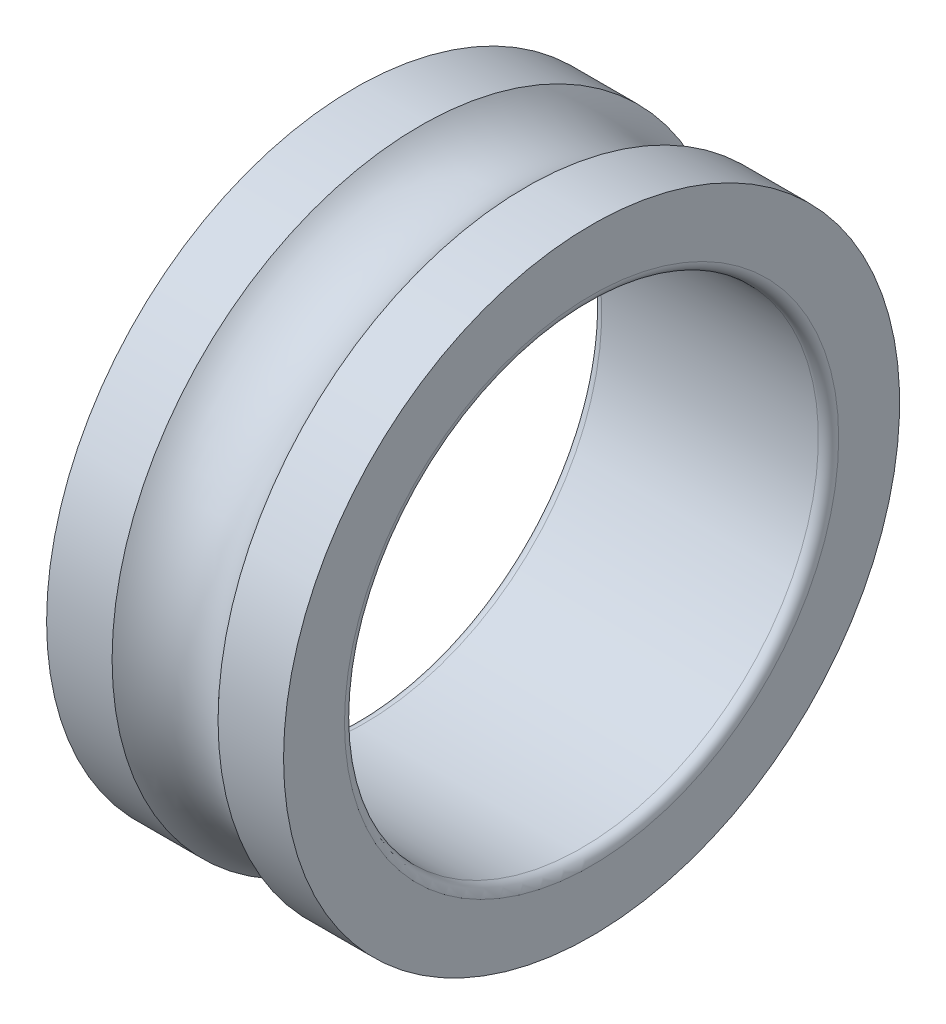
ISO-10303-21;
HEADER;
FILE_DESCRIPTION(('STEP AP214'),'2;1');
FILE_NAME('part.step','',(''),(''),'','','');
FILE_SCHEMA(('AUTOMOTIVE_DESIGN { 1 0 10303 214 1 1 1 1 }'));
ENDSEC;
DATA;
#1=APPLICATION_CONTEXT('core data for automotive mechanical design processes');
#2=APPLICATION_PROTOCOL_DEFINITION('international standard','automotive_design',2000,#1);
#3=PRODUCT_CONTEXT('',#1,'mechanical');
#4=PRODUCT('Part','Part','',(#3));
#5=PRODUCT_RELATED_PRODUCT_CATEGORY('part','',(#4));
#6=PRODUCT_DEFINITION_FORMATION('','',#4);
#7=PRODUCT_DEFINITION_CONTEXT('part definition',#1,'design');
#8=PRODUCT_DEFINITION('design','',#6,#7);
#9=PRODUCT_DEFINITION_SHAPE('','',#8);
#10=(LENGTH_UNIT() NAMED_UNIT(*) SI_UNIT(.MILLI.,.METRE.));
#11=(NAMED_UNIT(*) PLANE_ANGLE_UNIT() SI_UNIT($,.RADIAN.));
#12=(NAMED_UNIT(*) SI_UNIT($,.STERADIAN.) SOLID_ANGLE_UNIT());
#13=UNCERTAINTY_MEASURE_WITH_UNIT(LENGTH_MEASURE(1.E-05),#10,'distance_accuracy_value','');
#14=(GEOMETRIC_REPRESENTATION_CONTEXT(3) GLOBAL_UNCERTAINTY_ASSIGNED_CONTEXT((#13)) GLOBAL_UNIT_ASSIGNED_CONTEXT((#10,
#11,#12)) REPRESENTATION_CONTEXT('',''));
#15=CARTESIAN_POINT('',(0.,0.,0.));
#16=DIRECTION('',(0.,0.,1.));
#17=DIRECTION('',(1.,0.,0.));
#18=AXIS2_PLACEMENT_3D('',#15,#16,#17);
#19=CARTESIAN_POINT('',(0.150000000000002,0.,0.));
#20=DIRECTION('',(-1.,0.,0.));
#21=DIRECTION('',(0.,0.,1.));
#22=AXIS2_PLACEMENT_3D('',#19,#20,#21);
#23=TOROIDAL_SURFACE('',#22,3.65,0.15);
#24=CARTESIAN_POINT('',(0.150000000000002,0.,0.));
#25=DIRECTION('',(-1.,0.,0.));
#26=DIRECTION('',(0.,0.,1.));
#27=AXIS2_PLACEMENT_3D('',#24,#25,#26);
#28=CIRCLE('',#27,3.5);
#29=CARTESIAN_POINT('',(0.150000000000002,0.,3.5));
#30=VERTEX_POINT('',#29);
#31=EDGE_CURVE('E10',#30,#30,#28,.T.);
#32=ORIENTED_EDGE('',*,*,#31,.F.);
#33=EDGE_LOOP('',(#32));
#34=FACE_BOUND('',#33,.T.);
#35=CARTESIAN_POINT('',(0.,0.,0.));
#36=DIRECTION('',(-1.,0.,0.));
#37=DIRECTION('',(0.,0.,1.));
#38=AXIS2_PLACEMENT_3D('',#35,#36,#37);
#39=CIRCLE('',#38,3.65);
#40=CARTESIAN_POINT('',(0.,0.,3.65));
#41=VERTEX_POINT('',#40);
#42=EDGE_CURVE('E378',#41,#41,#39,.T.);
#43=ORIENTED_EDGE('',*,*,#42,.T.);
#44=EDGE_LOOP('',(#43));
#45=FACE_BOUND('',#44,.T.);
#46=ADVANCED_FACE('F350',(#34,#45),#23,.T.);
#47=CARTESIAN_POINT('',(0.,0.,0.));
#48=DIRECTION('',(-1.,0.,0.));
#49=DIRECTION('',(0.,0.,1.));
#50=AXIS2_PLACEMENT_3D('',#47,#48,#49);
#51=CYLINDRICAL_SURFACE('',#50,3.5);
#52=CARTESIAN_POINT('',(3.35,0.,0.));
#53=DIRECTION('',(-1.,0.,0.));
#54=DIRECTION('',(0.,0.,1.));
#55=AXIS2_PLACEMENT_3D('',#52,#53,#54);
#56=CIRCLE('',#55,3.5);
#57=CARTESIAN_POINT('',(3.35,0.,3.5));
#58=VERTEX_POINT('',#57);
#59=EDGE_CURVE('E356',#58,#58,#56,.T.);
#60=ORIENTED_EDGE('',*,*,#59,.F.);
#61=EDGE_LOOP('',(#60));
#62=FACE_BOUND('',#61,.T.);
#63=ORIENTED_EDGE('',*,*,#31,.T.);
#64=EDGE_LOOP('',(#63));
#65=FACE_BOUND('',#64,.T.);
#66=ADVANCED_FACE('F415',(#62,#65),#51,.F.);
#67=CARTESIAN_POINT('',(3.35,0.,0.));
#68=DIRECTION('',(-1.,0.,0.));
#69=DIRECTION('',(0.,0.,1.));
#70=AXIS2_PLACEMENT_3D('',#67,#68,#69);
#71=TOROIDAL_SURFACE('',#70,3.65,0.15);
#72=CARTESIAN_POINT('',(3.5,0.,0.));
#73=DIRECTION('',(-1.,0.,0.));
#74=DIRECTION('',(0.,0.,1.));
#75=AXIS2_PLACEMENT_3D('',#72,#73,#74);
#76=CIRCLE('',#75,3.65);
#77=CARTESIAN_POINT('',(3.5,0.,3.65));
#78=VERTEX_POINT('',#77);
#79=EDGE_CURVE('E360',#78,#78,#76,.T.);
#80=ORIENTED_EDGE('',*,*,#79,.F.);
#81=EDGE_LOOP('',(#80));
#82=FACE_BOUND('',#81,.T.);
#83=ORIENTED_EDGE('',*,*,#59,.T.);
#84=EDGE_LOOP('',(#83));
#85=FACE_BOUND('',#84,.T.);
#86=ADVANCED_FACE('F410',(#82,#85),#71,.T.);
#87=CARTESIAN_POINT('',(3.5,0.,-4.55));
#88=DIRECTION('',(-1.,0.,0.));
#89=DIRECTION('',(0.,0.,1.));
#90=AXIS2_PLACEMENT_3D('',#87,#88,#89);
#91=PLANE('',#90);
#92=CARTESIAN_POINT('',(3.5,0.,0.));
#93=DIRECTION('',(-1.,0.,0.));
#94=DIRECTION('',(0.,0.,1.));
#95=AXIS2_PLACEMENT_3D('',#92,#93,#94);
#96=CIRCLE('',#95,4.55);
#97=CARTESIAN_POINT('',(3.5,0.,4.55));
#98=VERTEX_POINT('',#97);
#99=EDGE_CURVE('E364',#98,#98,#96,.T.);
#100=ORIENTED_EDGE('',*,*,#99,.F.);
#101=EDGE_LOOP('',(#100));
#102=FACE_BOUND('',#101,.T.);
#103=ORIENTED_EDGE('',*,*,#79,.T.);
#104=EDGE_LOOP('',(#103));
#105=FACE_BOUND('',#104,.T.);
#106=ADVANCED_FACE('F404',(#102,#105),#91,.F.);
#107=CARTESIAN_POINT('',(0.,0.,0.));
#108=DIRECTION('',(-1.,0.,0.));
#109=DIRECTION('',(0.,0.,1.));
#110=AXIS2_PLACEMENT_3D('',#107,#108,#109);
#111=CYLINDRICAL_SURFACE('',#110,4.55);
#112=CARTESIAN_POINT('',(2.53262379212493,0.,0.));
#113=DIRECTION('',(-1.,0.,0.));
#114=DIRECTION('',(0.,0.,1.));
#115=AXIS2_PLACEMENT_3D('',#112,#113,#114);
#116=CIRCLE('',#115,4.55);
#117=CARTESIAN_POINT('',(2.53262379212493,0.,4.55));
#118=VERTEX_POINT('',#117);
#119=EDGE_CURVE('E369',#118,#118,#116,.T.);
#120=ORIENTED_EDGE('',*,*,#119,.F.);
#121=EDGE_LOOP('',(#120));
#122=FACE_BOUND('',#121,.T.);
#123=ORIENTED_EDGE('',*,*,#99,.T.);
#124=EDGE_LOOP('',(#123));
#125=FACE_BOUND('',#124,.T.);
#126=ADVANCED_FACE('F398',(#122,#125),#111,.T.);
#127=CARTESIAN_POINT('',(1.75,0.,0.));
#128=DIRECTION('',(-1.,0.,0.));
#129=DIRECTION('',(0.,0.,1.));
#130=AXIS2_PLACEMENT_3D('',#127,#128,#129);
#131=TOROIDAL_SURFACE('',#130,5.25,1.05);
#132=CARTESIAN_POINT('',(0.967376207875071,0.,0.));
#133=DIRECTION('',(-1.,0.,0.));
#134=DIRECTION('',(0.,0.,1.));
#135=AXIS2_PLACEMENT_3D('',#132,#133,#134);
#136=CIRCLE('',#135,4.55);
#137=CARTESIAN_POINT('',(0.967376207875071,0.,4.55));
#138=VERTEX_POINT('',#137);
#139=EDGE_CURVE('E372',#138,#138,#136,.T.);
#140=ORIENTED_EDGE('',*,*,#139,.F.);
#141=EDGE_LOOP('',(#140));
#142=FACE_BOUND('',#141,.T.);
#143=ORIENTED_EDGE('',*,*,#119,.T.);
#144=EDGE_LOOP('',(#143));
#145=FACE_BOUND('',#144,.T.);
#146=ADVANCED_FACE('F392',(#142,#145),#131,.F.);
#147=CARTESIAN_POINT('',(0.,0.,0.));
#148=DIRECTION('',(-1.,0.,0.));
#149=DIRECTION('',(0.,0.,1.));
#150=AXIS2_PLACEMENT_3D('',#147,#148,#149);
#151=CYLINDRICAL_SURFACE('',#150,4.55);
#152=CARTESIAN_POINT('',(0.,0.,0.));
#153=DIRECTION('',(-1.,0.,0.));
#154=DIRECTION('',(0.,0.,1.));
#155=AXIS2_PLACEMENT_3D('',#152,#153,#154);
#156=CIRCLE('',#155,4.55);
#157=CARTESIAN_POINT('',(0.,0.,4.55));
#158=VERTEX_POINT('',#157);
#159=EDGE_CURVE('E375',#158,#158,#156,.T.);
#160=ORIENTED_EDGE('',*,*,#159,.F.);
#161=EDGE_LOOP('',(#160));
#162=FACE_BOUND('',#161,.T.);
#163=ORIENTED_EDGE('',*,*,#139,.T.);
#164=EDGE_LOOP('',(#163));
#165=FACE_BOUND('',#164,.T.);
#166=ADVANCED_FACE('F386',(#162,#165),#151,.T.);
#167=CARTESIAN_POINT('',(0.,0.,-4.55));
#168=DIRECTION('',(1.,0.,0.));
#169=DIRECTION('',(0.,0.,-1.));
#170=AXIS2_PLACEMENT_3D('',#167,#168,#169);
#171=PLANE('',#170);
#172=ORIENTED_EDGE('',*,*,#42,.F.);
#173=EDGE_LOOP('',(#172));
#174=FACE_BOUND('',#173,.T.);
#175=ORIENTED_EDGE('',*,*,#159,.T.);
#176=EDGE_LOOP('',(#175));
#177=FACE_BOUND('',#176,.T.);
#178=ADVANCED_FACE('F383',(#174,#177),#171,.F.);
#179=CLOSED_SHELL('',(#46,#66,#86,#106,#126,#146,#166,#178));
#180=MANIFOLD_SOLID_BREP('B2',#179);
#181=ADVANCED_BREP_SHAPE_REPRESENTATION('',(#18,#180),#14);
#182=SHAPE_DEFINITION_REPRESENTATION(#9,#181);
ENDSEC;
END-ISO-10303-21;
